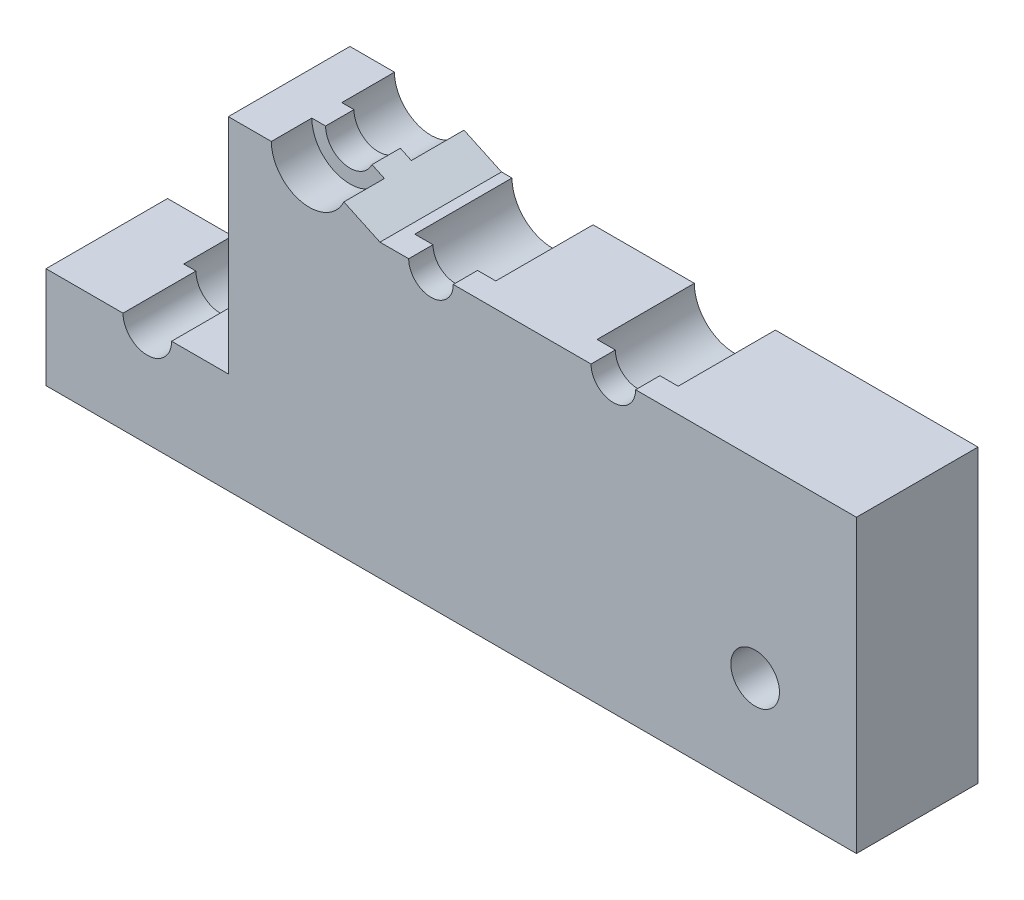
from build123d import *

# Parameters (mm, degrees)
ESQUISSE1_W                   = 200
ESQUISSE1_H                   = 150
BASE_EXTRUSION_DEPTH          = 30
ESQUISSE2_R                   = 9.39
ENL_V_MAT_EXTRU_1_DEPTH       = 10
ESQUISSE3_R                   = 6
ENL_V_MAT_EXTRU_2_DEPTH       = 7
ESQUISSE10_R                  = 9
ENL_V_MAT_EXTRU_9_DEPTH       = 251.577333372
ESQUISSE11_R                  = 5.5
ENL_V_MAT_EXTRU_10_DEPTH      = 6
ESQUISSE12_R                  = 10
ENL_V_MAT_EXTRU_11_DEPTH      = 252.149357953
ESQUISSE8_R                   = 6
ENL_V_MAT_EXTRU_7_DEPTH       = 18
ESQUISSE9_R                   = 9
ENL_V_MAT_EXTRU_8_DEPTH       = 251.647162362
ENL_V_MAT_EXTRU_12_DEPTH      = 252.79356624
ENL_V_MAT_EXTRU_12_DEPTH_BACK = 252.79356624


with BuildPart() as part:
    # Esquisse1 → Base-Extrusion (new body)
    with BuildSketch(Plane.XY):
        with Locations((100, 75)):
            Rectangle(ESQUISSE1_W, ESQUISSE1_H)
    extrude(amount=BASE_EXTRUSION_DEPTH)

    # Esquisse2 → Enl_v. mat.-Extru.1 (cut)
    with BuildSketch(Plane.XY.offset(30)):
        with Locations((65, 80)):
            Circle(ESQUISSE2_R)
    extrude(amount=-ENL_V_MAT_EXTRU_1_DEPTH, mode=Mode.SUBTRACT)

    # Esquisse3 → Enl_v. mat.-Extru.2 (cut)
    with BuildSketch(Plane.XY.offset(20)):
        with Locations((65, 80)):
            Circle(ESQUISSE3_R)
    extrude(amount=-ENL_V_MAT_EXTRU_2_DEPTH, mode=Mode.SUBTRACT)

    # Esquisse10 → Enl_v. mat.-Extru.9 (cut, through all)
    with BuildSketch(Plane.XY.offset(13)):
        with Locations((65, 80)):
            Circle(ESQUISSE10_R)
    extrude(amount=-ENL_V_MAT_EXTRU_9_DEPTH, mode=Mode.SUBTRACT)

    # Esquisse11 → Enl_v. mat.-Extru.10 (cut)
    with BuildSketch(Plane.XY.offset(30)):
        with Locations((95, 71.88)):
            Circle(ESQUISSE11_R)
        with Locations((140, 71.88)):
            Circle(ESQUISSE11_R)
    extrude(amount=-ENL_V_MAT_EXTRU_10_DEPTH, mode=Mode.SUBTRACT)

    # Esquisse12 → Enl_v. mat.-Extru.11 (cut, through all)
    with BuildSketch(Plane.XY.offset(24)):
        with Locations((140, 71.88)):
            Circle(ESQUISSE12_R)
        with Locations((95, 71.88)):
            Circle(ESQUISSE12_R)
    extrude(amount=-ENL_V_MAT_EXTRU_11_DEPTH, mode=Mode.SUBTRACT)

    # Esquisse8 → Enl_v. mat.-Extru.7 (cut)
    with BuildSketch(Plane.XY.offset(30)):
        with Locations((25, 125)):
            Circle(ESQUISSE8_R)
        with Locations((25, 25)):
            Circle(ESQUISSE8_R)
        with Locations((175, 25)):
            Circle(ESQUISSE8_R)
        with Locations((175, 125)):
            Circle(ESQUISSE8_R)
    extrude(amount=-ENL_V_MAT_EXTRU_7_DEPTH, mode=Mode.SUBTRACT)

    # Esquisse9 → Enl_v. mat.-Extru.8 (cut, through all)
    with BuildSketch(Plane.XY.offset(12)):
        with Locations((25, 125)):
            Circle(ESQUISSE9_R)
        with Locations((175, 125)):
            Circle(ESQUISSE9_R)
        with Locations((175, 25)):
            Circle(ESQUISSE9_R)
        with Locations((25, 25)):
            Circle(ESQUISSE9_R)
    extrude(amount=-ENL_V_MAT_EXTRU_8_DEPTH, mode=Mode.SUBTRACT)

    # Esquisse13 → Enl_v. mat.-Extru.12 (cut, two sides: drawn at the far end of the back side and taken through both)
    with BuildSketch(Plane(origin=(0, 0, 0), x_dir=(-1, 0, 0), z_dir=(0, 0, -1)).offset(-ENL_V_MAT_EXTRU_12_DEPTH_BACK)):
        Polygon((496.254715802, 25), (5.386416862, 25), (-45, 25), (-45, 80), (-65, 80), (-82.413396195, 71.88), (-209.810437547, 71.88), (-700.678736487, 71.88), (-662.256758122, 1052.864454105), (534.676694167, 1005.984454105), align=None)
    extrude(amount=ENL_V_MAT_EXTRU_12_DEPTH + ENL_V_MAT_EXTRU_12_DEPTH_BACK, mode=Mode.SUBTRACT)


solid = part.part
